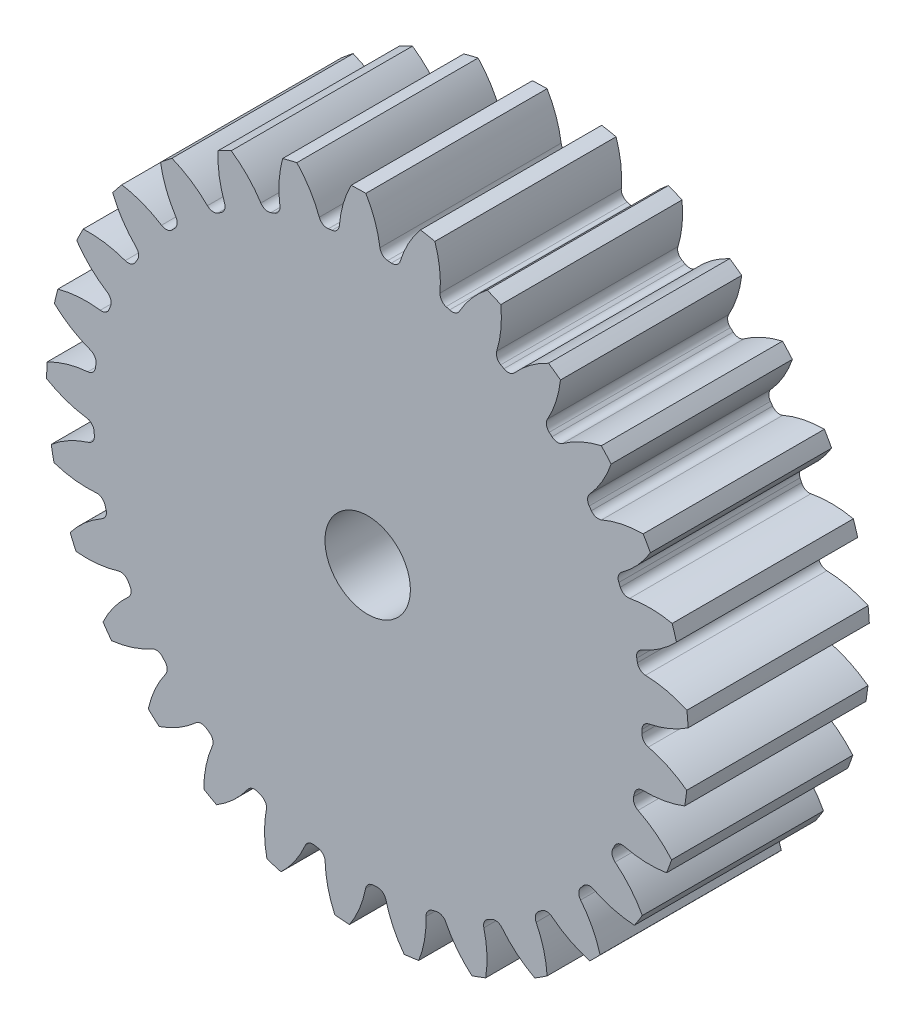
from build123d import *

# Parameters (mm, degrees)
SKETCH3_R         = 157.48
GEARBODY_DEPTH    = 88.9
TOOTHCUT_DEPTH    = 240.798062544
CIRPATTERN1_COUNT = 29
BOREDIA_R         = 20.955
BORE_DEPTH        = 12700


with BuildPart() as part:
    # Sketch3 → gearBody (new body)
    with BuildSketch(Plane.XY):
        Circle(SKETCH3_R)
    extrude(amount=GEARBODY_DEPTH)

    # Sketch2 → toothCut (cut, through all)
    with BuildSketch(Plane.XY):
        with BuildLine():
            ThreePointArc((134.549552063, -4.354588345), (134.576031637, -3.440364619), (134.596299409, -2.525982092))
            ThreePointArc((134.596299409, -2.525982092), (135.564076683, 0.05570709), (137.939619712, 1.455173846))
            ThreePointArc((137.939619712, 1.455173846), (148.125579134, 4.539696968), (157.48, 9.615409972))
            ThreePointArc((157.48, 9.615409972), (157.721745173, -4.032072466), (156.782990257, -17.649376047))
            ThreePointArc((156.782990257, -17.649376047), (147.700134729, -12.102323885), (137.685085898, -8.50137274))
            ThreePointArc((137.685085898, -8.50137274), (135.384152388, -6.982354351), (134.549552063, -4.354588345))
        make_face()
    toothcut = extrude(amount=TOOTHCUT_DEPTH, mode=Mode.SUBTRACT)

    # CirPattern1: toothCut ×29 about axis
    cirpattern1_axis = Axis((0, 0, 0), (0, 0, 1))
    for i in range(1, CIRPATTERN1_COUNT):
        add(toothcut.rotate(cirpattern1_axis, i * 360 / CIRPATTERN1_COUNT), mode=Mode.SUBTRACT)

    # boreDia → bore (cut, symmetric)
    with BuildSketch(Plane.XY):
        Circle(BOREDIA_R)
    extrude(amount=BORE_DEPTH, both=True, mode=Mode.SUBTRACT)


solid = part.part
